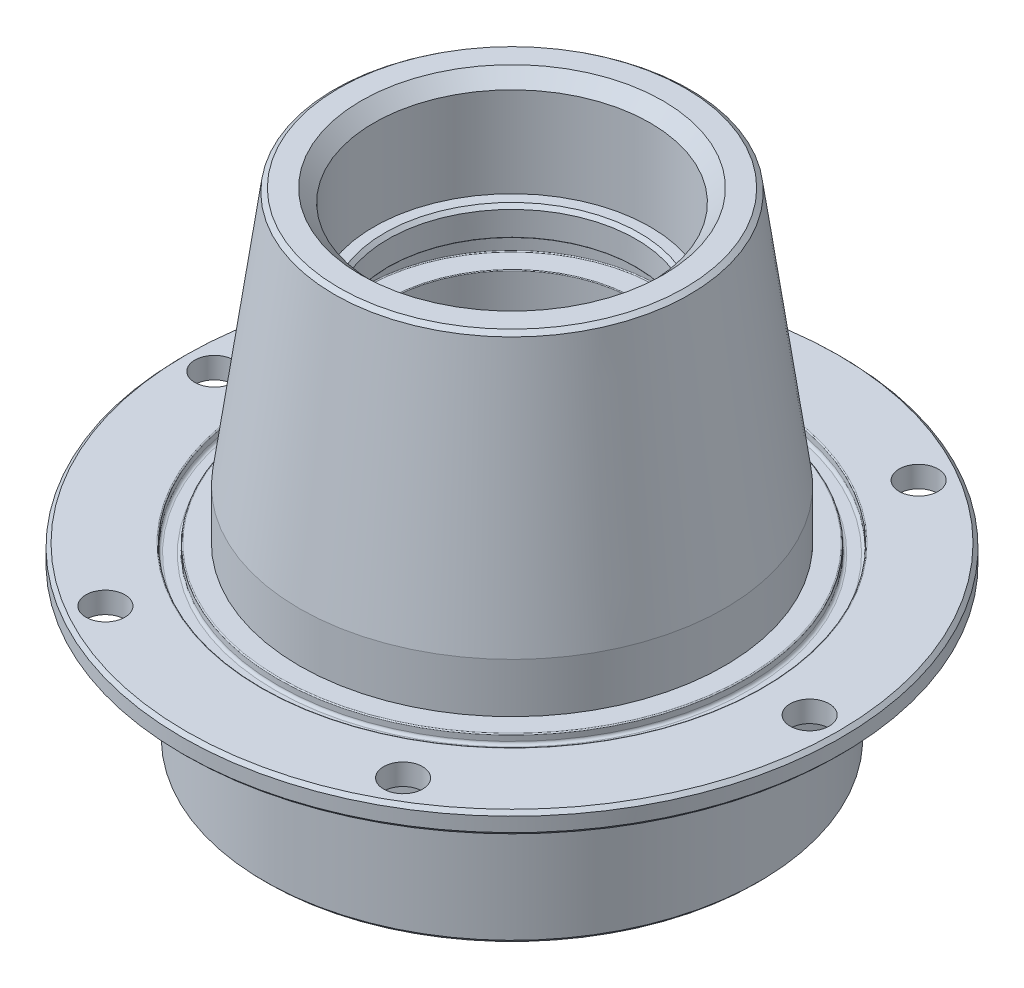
ISO-10303-21;
HEADER;
FILE_DESCRIPTION(('STEP AP214'),'2;1');
FILE_NAME('part.step','',(''),(''),'','','');
FILE_SCHEMA(('AUTOMOTIVE_DESIGN { 1 0 10303 214 1 1 1 1 }'));
ENDSEC;
DATA;
#1=APPLICATION_CONTEXT('core data for automotive mechanical design processes');
#2=APPLICATION_PROTOCOL_DEFINITION('international standard','automotive_design',2000,#1);
#3=PRODUCT_CONTEXT('',#1,'mechanical');
#4=PRODUCT('Part','Part','',(#3));
#5=PRODUCT_RELATED_PRODUCT_CATEGORY('part','',(#4));
#6=PRODUCT_DEFINITION_FORMATION('','',#4);
#7=PRODUCT_DEFINITION_CONTEXT('part definition',#1,'design');
#8=PRODUCT_DEFINITION('design','',#6,#7);
#9=PRODUCT_DEFINITION_SHAPE('','',#8);
#10=(LENGTH_UNIT() NAMED_UNIT(*) SI_UNIT(.MILLI.,.METRE.));
#11=(NAMED_UNIT(*) PLANE_ANGLE_UNIT() SI_UNIT($,.RADIAN.));
#12=(NAMED_UNIT(*) SI_UNIT($,.STERADIAN.) SOLID_ANGLE_UNIT());
#13=UNCERTAINTY_MEASURE_WITH_UNIT(LENGTH_MEASURE(1.E-05),#10,'distance_accuracy_value','');
#14=(GEOMETRIC_REPRESENTATION_CONTEXT(3) GLOBAL_UNCERTAINTY_ASSIGNED_CONTEXT((#13)) GLOBAL_UNIT_ASSIGNED_CONTEXT((#10,
#11,#12)) REPRESENTATION_CONTEXT('',''));
#15=CARTESIAN_POINT('',(0.,0.,0.));
#16=DIRECTION('',(0.,0.,1.));
#17=DIRECTION('',(1.,0.,0.));
#18=AXIS2_PLACEMENT_3D('',#15,#16,#17);
#19=CARTESIAN_POINT('',(0.,0.,0.));
#20=DIRECTION('',(0.,-1.,0.));
#21=DIRECTION('',(0.,0.,-1.));
#22=AXIS2_PLACEMENT_3D('',#19,#20,#21);
#23=CONICAL_SURFACE('',#22,25.,0.136484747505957);
#24=CARTESIAN_POINT('',(0.,-0.495350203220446,0.));
#25=DIRECTION('',(0.,1.,0.));
#26=DIRECTION('',(0.,0.,1.));
#27=AXIS2_PLACEMENT_3D('',#24,#25,#26);
#28=CIRCLE('',#27,25.0680307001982);
#29=CARTESIAN_POINT('',(0.,-0.495350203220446,25.0680307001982));
#30=VERTEX_POINT('',#29);
#31=EDGE_CURVE('E118',#30,#30,#28,.F.);
#32=ORIENTED_EDGE('',*,*,#31,.T.);
#33=EDGE_LOOP('',(#32));
#34=FACE_BOUND('',#33,.T.);
#35=CARTESIAN_POINT('',(0.,-36.4063725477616,0.));
#36=DIRECTION('',(0.,1.,0.));
#37=DIRECTION('',(0.,0.,1.));
#38=AXIS2_PLACEMENT_3D('',#35,#36,#37);
#39=CIRCLE('',#38,30.);
#40=CARTESIAN_POINT('',(0.,-36.4063725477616,30.));
#41=VERTEX_POINT('',#40);
#42=EDGE_CURVE('E166',#41,#41,#39,.T.);
#43=ORIENTED_EDGE('',*,*,#42,.T.);
#44=EDGE_LOOP('',(#43));
#45=FACE_BOUND('',#44,.T.);
#46=ADVANCED_FACE('F32',(#34,#45),#23,.T.);
#47=CARTESIAN_POINT('',(0.,58.1117219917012,0.));
#48=DIRECTION('',(0.,1.,0.));
#49=DIRECTION('',(0.,0.,1.));
#50=AXIS2_PLACEMENT_3D('',#47,#48,#49);
#51=CYLINDRICAL_SURFACE('',#50,30.);
#52=CARTESIAN_POINT('',(0.,-43.4063725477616,0.));
#53=DIRECTION('',(0.,1.,0.));
#54=DIRECTION('',(0.,0.,1.));
#55=AXIS2_PLACEMENT_3D('',#52,#53,#54);
#56=CIRCLE('',#55,30.);
#57=CARTESIAN_POINT('',(0.,-43.4063725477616,30.));
#58=VERTEX_POINT('',#57);
#59=EDGE_CURVE('E169',#58,#58,#56,.T.);
#60=ORIENTED_EDGE('',*,*,#59,.T.);
#61=EDGE_LOOP('',(#60));
#62=FACE_BOUND('',#61,.T.);
#63=ORIENTED_EDGE('',*,*,#42,.F.);
#64=EDGE_LOOP('',(#63));
#65=FACE_BOUND('',#64,.T.);
#66=ADVANCED_FACE('F281',(#62,#65),#51,.T.);
#67=CARTESIAN_POINT('',(-33.,-43.4063725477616,0.));
#68=DIRECTION('',(0.,1.,0.));
#69=DIRECTION('',(0.,0.,1.));
#70=AXIS2_PLACEMENT_3D('',#67,#68,#69);
#71=PLANE('',#70);
#72=CARTESIAN_POINT('',(0.,-43.4063725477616,0.));
#73=DIRECTION('',(0.,1.,0.));
#74=DIRECTION('',(0.,0.,1.));
#75=AXIS2_PLACEMENT_3D('',#72,#73,#74);
#76=CIRCLE('',#75,32.85);
#77=CARTESIAN_POINT('',(0.,-43.4063725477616,32.85));
#78=VERTEX_POINT('',#77);
#79=EDGE_CURVE('E109',#78,#78,#76,.T.);
#80=ORIENTED_EDGE('',*,*,#79,.T.);
#81=EDGE_LOOP('',(#80));
#82=FACE_BOUND('',#81,.T.);
#83=ORIENTED_EDGE('',*,*,#59,.F.);
#84=EDGE_LOOP('',(#83));
#85=FACE_BOUND('',#84,.T.);
#86=ADVANCED_FACE('F287',(#82,#85),#71,.T.);
#87=CARTESIAN_POINT('',(0.,58.1117219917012,0.));
#88=DIRECTION('',(0.,1.,0.));
#89=DIRECTION('',(0.,0.,1.));
#90=AXIS2_PLACEMENT_3D('',#87,#88,#89);
#91=CYLINDRICAL_SURFACE('',#90,33.);
#92=CARTESIAN_POINT('',(0.,-44.3063725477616,0.));
#93=DIRECTION('',(0.,1.,0.));
#94=DIRECTION('',(0.,0.,1.));
#95=AXIS2_PLACEMENT_3D('',#92,#93,#94);
#96=CIRCLE('',#95,33.);
#97=CARTESIAN_POINT('',(0.,-44.3063725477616,33.));
#98=VERTEX_POINT('',#97);
#99=EDGE_CURVE('E88',#98,#98,#96,.T.);
#100=ORIENTED_EDGE('',*,*,#99,.T.);
#101=EDGE_LOOP('',(#100));
#102=FACE_BOUND('',#101,.T.);
#103=CARTESIAN_POINT('',(0.,-43.5563725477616,0.));
#104=DIRECTION('',(0.,1.,0.));
#105=DIRECTION('',(0.,0.,1.));
#106=AXIS2_PLACEMENT_3D('',#103,#104,#105);
#107=CIRCLE('',#106,33.);
#108=CARTESIAN_POINT('',(0.,-43.5563725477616,33.));
#109=VERTEX_POINT('',#108);
#110=EDGE_CURVE('E106',#109,#109,#107,.F.);
#111=ORIENTED_EDGE('',*,*,#110,.T.);
#112=EDGE_LOOP('',(#111));
#113=FACE_BOUND('',#112,.T.);
#114=ADVANCED_FACE('F403',(#102,#113),#91,.T.);
#115=CARTESIAN_POINT('',(-35.28,-44.7063725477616,0.));
#116=DIRECTION('',(0.,1.,0.));
#117=DIRECTION('',(0.,0.,1.));
#118=AXIS2_PLACEMENT_3D('',#115,#116,#117);
#119=PLANE('',#118);
#120=CARTESIAN_POINT('',(0.,-44.7063725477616,0.));
#121=DIRECTION('',(0.,1.,0.));
#122=DIRECTION('',(0.,0.,1.));
#123=AXIS2_PLACEMENT_3D('',#120,#121,#122);
#124=CIRCLE('',#123,34.88);
#125=CARTESIAN_POINT('',(0.,-44.7063725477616,34.88));
#126=VERTEX_POINT('',#125);
#127=EDGE_CURVE('E94',#126,#126,#124,.T.);
#128=ORIENTED_EDGE('',*,*,#127,.T.);
#129=EDGE_LOOP('',(#128));
#130=FACE_BOUND('',#129,.T.);
#131=CARTESIAN_POINT('',(0.,-44.7063725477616,0.));
#132=DIRECTION('',(0.,1.,0.));
#133=DIRECTION('',(0.,0.,1.));
#134=AXIS2_PLACEMENT_3D('',#131,#132,#133);
#135=CIRCLE('',#134,33.4);
#136=CARTESIAN_POINT('',(0.,-44.7063725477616,33.4));
#137=VERTEX_POINT('',#136);
#138=EDGE_CURVE('E97',#137,#137,#135,.F.);
#139=ORIENTED_EDGE('',*,*,#138,.T.);
#140=EDGE_LOOP('',(#139));
#141=FACE_BOUND('',#140,.T.);
#142=ADVANCED_FACE('F399',(#130,#141),#119,.T.);
#143=CARTESIAN_POINT('',(0.,58.1117219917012,0.));
#144=DIRECTION('',(0.,1.,0.));
#145=DIRECTION('',(0.,0.,1.));
#146=AXIS2_PLACEMENT_3D('',#143,#144,#145);
#147=CYLINDRICAL_SURFACE('',#146,35.28);
#148=CARTESIAN_POINT('',(0.,-44.3063725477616,0.));
#149=DIRECTION('',(0.,1.,0.));
#150=DIRECTION('',(0.,0.,1.));
#151=AXIS2_PLACEMENT_3D('',#148,#149,#150);
#152=CIRCLE('',#151,35.28);
#153=CARTESIAN_POINT('',(0.,-44.3063725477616,35.28));
#154=VERTEX_POINT('',#153);
#155=EDGE_CURVE('E91',#154,#154,#152,.F.);
#156=ORIENTED_EDGE('',*,*,#155,.T.);
#157=EDGE_LOOP('',(#156));
#158=FACE_BOUND('',#157,.T.);
#159=CARTESIAN_POINT('',(0.,-43.5563725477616,0.));
#160=DIRECTION('',(0.,1.,0.));
#161=DIRECTION('',(0.,0.,1.));
#162=AXIS2_PLACEMENT_3D('',#159,#160,#161);
#163=CIRCLE('',#162,35.28);
#164=CARTESIAN_POINT('',(0.,-43.5563725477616,35.28));
#165=VERTEX_POINT('',#164);
#166=EDGE_CURVE('E103',#165,#165,#163,.T.);
#167=ORIENTED_EDGE('',*,*,#166,.T.);
#168=EDGE_LOOP('',(#167));
#169=FACE_BOUND('',#168,.T.);
#170=ADVANCED_FACE('F247',(#158,#169),#147,.F.);
#171=CARTESIAN_POINT('',(-46.5,-43.4063725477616,0.));
#172=DIRECTION('',(0.,1.,0.));
#173=DIRECTION('',(0.,0.,1.));
#174=AXIS2_PLACEMENT_3D('',#171,#172,#173);
#175=PLANE('',#174);
#176=CARTESIAN_POINT('',(-21.0000000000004,-43.4063725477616,36.3730669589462));
#177=DIRECTION('',(0.,1.,0.));
#178=DIRECTION('',(0.866025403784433,0.,0.50000000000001));
#179=AXIS2_PLACEMENT_3D('',#176,#177,#178);
#180=CIRCLE('',#179,2.75);
#181=CARTESIAN_POINT('',(-18.6184301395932,-43.4063725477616,37.7480669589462));
#182=VERTEX_POINT('',#181);
#183=EDGE_CURVE('E227',#182,#182,#180,.T.);
#184=ORIENTED_EDGE('',*,*,#183,.F.);
#185=EDGE_LOOP('',(#184));
#186=FACE_BOUND('',#185,.T.);
#187=CARTESIAN_POINT('',(20.9999999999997,-43.4063725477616,36.3730669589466));
#188=DIRECTION('',(0.,1.,0.));
#189=DIRECTION('',(0.866025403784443,0.,-0.499999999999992));
#190=AXIS2_PLACEMENT_3D('',#187,#188,#189);
#191=CIRCLE('',#190,2.75);
#192=CARTESIAN_POINT('',(23.3815698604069,-43.4063725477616,34.9980669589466));
#193=VERTEX_POINT('',#192);
#194=EDGE_CURVE('E221',#193,#193,#191,.T.);
#195=ORIENTED_EDGE('',*,*,#194,.F.);
#196=EDGE_LOOP('',(#195));
#197=FACE_BOUND('',#196,.T.);
#198=CARTESIAN_POINT('',(42.,-43.4063725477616,2.93284602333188E-13));
#199=DIRECTION('',(0.,1.,0.));
#200=DIRECTION('',(0.,0.,-1.));
#201=AXIS2_PLACEMENT_3D('',#198,#199,#200);
#202=CIRCLE('',#201,2.75);
#203=CARTESIAN_POINT('',(42.,-43.4063725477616,-2.74999999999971));
#204=VERTEX_POINT('',#203);
#205=EDGE_CURVE('E215',#204,#204,#202,.T.);
#206=ORIENTED_EDGE('',*,*,#205,.F.);
#207=EDGE_LOOP('',(#206));
#208=FACE_BOUND('',#207,.T.);
#209=CARTESIAN_POINT('',(21.0000000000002,-43.4063725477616,-36.3730669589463));
#210=DIRECTION('',(0.,1.,0.));
#211=DIRECTION('',(-0.866025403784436,0.,-0.500000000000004));
#212=AXIS2_PLACEMENT_3D('',#209,#210,#211);
#213=CIRCLE('',#212,2.75);
#214=CARTESIAN_POINT('',(18.618430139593,-43.4063725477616,-37.7480669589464));
#215=VERTEX_POINT('',#214);
#216=EDGE_CURVE('E209',#215,#215,#213,.T.);
#217=ORIENTED_EDGE('',*,*,#216,.F.);
#218=EDGE_LOOP('',(#217));
#219=FACE_BOUND('',#218,.T.);
#220=CARTESIAN_POINT('',(-20.9999999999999,-43.4063725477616,-36.3730669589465));
#221=DIRECTION('',(0.,1.,0.));
#222=DIRECTION('',(-0.86602540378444,0.,0.499999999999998));
#223=AXIS2_PLACEMENT_3D('',#220,#221,#222);
#224=CIRCLE('',#223,2.75);
#225=CARTESIAN_POINT('',(-23.3815698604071,-43.4063725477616,-34.9980669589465));
#226=VERTEX_POINT('',#225);
#227=EDGE_CURVE('E203',#226,#226,#224,.T.);
#228=ORIENTED_EDGE('',*,*,#227,.F.);
#229=EDGE_LOOP('',(#228));
#230=FACE_BOUND('',#229,.T.);
#231=CARTESIAN_POINT('',(-42.,-43.4063725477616,0.));
#232=DIRECTION('',(0.,1.,0.));
#233=DIRECTION('',(0.,0.,1.));
#234=AXIS2_PLACEMENT_3D('',#231,#232,#233);
#235=CIRCLE('',#234,2.75);
#236=CARTESIAN_POINT('',(-42.,-43.4063725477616,2.75));
#237=VERTEX_POINT('',#236);
#238=EDGE_CURVE('E197',#237,#237,#235,.T.);
#239=ORIENTED_EDGE('',*,*,#238,.F.);
#240=EDGE_LOOP('',(#239));
#241=FACE_BOUND('',#240,.T.);
#242=CARTESIAN_POINT('',(0.,-43.4063725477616,0.));
#243=DIRECTION('',(0.,1.,0.));
#244=DIRECTION('',(0.,0.,1.));
#245=AXIS2_PLACEMENT_3D('',#242,#243,#244);
#246=CIRCLE('',#245,35.43);
#247=CARTESIAN_POINT('',(0.,-43.4063725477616,35.43));
#248=VERTEX_POINT('',#247);
#249=EDGE_CURVE('E100',#248,#248,#246,.F.);
#250=ORIENTED_EDGE('',*,*,#249,.T.);
#251=EDGE_LOOP('',(#250));
#252=FACE_BOUND('',#251,.T.);
#253=CARTESIAN_POINT('',(0.,-43.4063725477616,0.));
#254=DIRECTION('',(0.,1.,0.));
#255=DIRECTION('',(0.,0.,1.));
#256=AXIS2_PLACEMENT_3D('',#253,#254,#255);
#257=CIRCLE('',#256,46.);
#258=CARTESIAN_POINT('',(0.,-43.4063725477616,46.));
#259=VERTEX_POINT('',#258);
#260=EDGE_CURVE('E148',#259,#259,#257,.T.);
#261=ORIENTED_EDGE('',*,*,#260,.T.);
#262=EDGE_LOOP('',(#261));
#263=FACE_BOUND('',#262,.T.);
#264=ADVANCED_FACE('F243',(#186,#197,#208,#219,#230,#241,#252,#263),#175,.T.);
#265=CARTESIAN_POINT('',(0.,58.1117219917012,0.));
#266=DIRECTION('',(0.,1.,0.));
#267=DIRECTION('',(0.,0.,1.));
#268=AXIS2_PLACEMENT_3D('',#265,#266,#267);
#269=CYLINDRICAL_SURFACE('',#268,46.5);
#270=CARTESIAN_POINT('',(0.,-43.9063725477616,0.));
#271=DIRECTION('',(0.,1.,0.));
#272=DIRECTION('',(0.,0.,1.));
#273=AXIS2_PLACEMENT_3D('',#270,#271,#272);
#274=CIRCLE('',#273,46.5);
#275=CARTESIAN_POINT('',(0.,-43.9063725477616,46.5));
#276=VERTEX_POINT('',#275);
#277=EDGE_CURVE('E142',#276,#276,#274,.F.);
#278=ORIENTED_EDGE('',*,*,#277,.T.);
#279=EDGE_LOOP('',(#278));
#280=FACE_BOUND('',#279,.T.);
#281=CARTESIAN_POINT('',(0.,-45.9063725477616,0.));
#282=DIRECTION('',(0.,-1.,0.));
#283=DIRECTION('',(0.,0.,-1.));
#284=AXIS2_PLACEMENT_3D('',#281,#282,#283);
#285=CIRCLE('',#284,46.5);
#286=CARTESIAN_POINT('',(0.,-45.9063725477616,-46.5));
#287=VERTEX_POINT('',#286);
#288=EDGE_CURVE('E145',#287,#287,#285,.F.);
#289=ORIENTED_EDGE('',*,*,#288,.T.);
#290=EDGE_LOOP('',(#289));
#291=FACE_BOUND('',#290,.T.);
#292=ADVANCED_FACE('F246',(#280,#291),#269,.T.);
#293=CARTESIAN_POINT('',(-35.,-46.4063725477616,0.));
#294=DIRECTION('',(0.,-1.,0.));
#295=DIRECTION('',(0.,0.,-1.));
#296=AXIS2_PLACEMENT_3D('',#293,#294,#295);
#297=PLANE('',#296);
#298=CARTESIAN_POINT('',(-21.0000000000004,-46.4063725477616,36.3730669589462));
#299=DIRECTION('',(0.,1.,0.));
#300=DIRECTION('',(0.866025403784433,0.,0.50000000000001));
#301=AXIS2_PLACEMENT_3D('',#298,#299,#300);
#302=CIRCLE('',#301,2.75);
#303=CARTESIAN_POINT('',(-18.6184301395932,-46.4063725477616,37.7480669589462));
#304=VERTEX_POINT('',#303);
#305=EDGE_CURVE('E224',#304,#304,#302,.T.);
#306=ORIENTED_EDGE('',*,*,#305,.T.);
#307=EDGE_LOOP('',(#306));
#308=FACE_BOUND('',#307,.T.);
#309=CARTESIAN_POINT('',(20.9999999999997,-46.4063725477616,36.3730669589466));
#310=DIRECTION('',(0.,1.,0.));
#311=DIRECTION('',(0.866025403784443,0.,-0.499999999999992));
#312=AXIS2_PLACEMENT_3D('',#309,#310,#311);
#313=CIRCLE('',#312,2.75);
#314=CARTESIAN_POINT('',(23.3815698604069,-46.4063725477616,34.9980669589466));
#315=VERTEX_POINT('',#314);
#316=EDGE_CURVE('E218',#315,#315,#313,.T.);
#317=ORIENTED_EDGE('',*,*,#316,.T.);
#318=EDGE_LOOP('',(#317));
#319=FACE_BOUND('',#318,.T.);
#320=CARTESIAN_POINT('',(42.,-46.4063725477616,2.93284602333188E-13));
#321=DIRECTION('',(0.,1.,0.));
#322=DIRECTION('',(0.,0.,-1.));
#323=AXIS2_PLACEMENT_3D('',#320,#321,#322);
#324=CIRCLE('',#323,2.75);
#325=CARTESIAN_POINT('',(42.,-46.4063725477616,-2.74999999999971));
#326=VERTEX_POINT('',#325);
#327=EDGE_CURVE('E212',#326,#326,#324,.T.);
#328=ORIENTED_EDGE('',*,*,#327,.T.);
#329=EDGE_LOOP('',(#328));
#330=FACE_BOUND('',#329,.T.);
#331=CARTESIAN_POINT('',(21.0000000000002,-46.4063725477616,-36.3730669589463));
#332=DIRECTION('',(0.,1.,0.));
#333=DIRECTION('',(-0.866025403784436,0.,-0.500000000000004));
#334=AXIS2_PLACEMENT_3D('',#331,#332,#333);
#335=CIRCLE('',#334,2.75);
#336=CARTESIAN_POINT('',(18.618430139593,-46.4063725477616,-37.7480669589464));
#337=VERTEX_POINT('',#336);
#338=EDGE_CURVE('E206',#337,#337,#335,.T.);
#339=ORIENTED_EDGE('',*,*,#338,.T.);
#340=EDGE_LOOP('',(#339));
#341=FACE_BOUND('',#340,.T.);
#342=CARTESIAN_POINT('',(-20.9999999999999,-46.4063725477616,-36.3730669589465));
#343=DIRECTION('',(0.,1.,0.));
#344=DIRECTION('',(-0.86602540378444,0.,0.499999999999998));
#345=AXIS2_PLACEMENT_3D('',#342,#343,#344);
#346=CIRCLE('',#345,2.75);
#347=CARTESIAN_POINT('',(-23.3815698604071,-46.4063725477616,-34.9980669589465));
#348=VERTEX_POINT('',#347);
#349=EDGE_CURVE('E200',#348,#348,#346,.T.);
#350=ORIENTED_EDGE('',*,*,#349,.T.);
#351=EDGE_LOOP('',(#350));
#352=FACE_BOUND('',#351,.T.);
#353=CARTESIAN_POINT('',(-42.,-46.4063725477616,0.));
#354=DIRECTION('',(0.,1.,0.));
#355=DIRECTION('',(0.,0.,1.));
#356=AXIS2_PLACEMENT_3D('',#353,#354,#355);
#357=CIRCLE('',#356,2.75);
#358=CARTESIAN_POINT('',(-42.,-46.4063725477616,2.75));
#359=VERTEX_POINT('',#358);
#360=EDGE_CURVE('E196',#359,#359,#357,.T.);
#361=ORIENTED_EDGE('',*,*,#360,.T.);
#362=EDGE_LOOP('',(#361));
#363=FACE_BOUND('',#362,.T.);
#364=CARTESIAN_POINT('',(0.,-46.4063725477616,0.));
#365=DIRECTION('',(0.,-1.,0.));
#366=DIRECTION('',(0.,0.,-1.));
#367=AXIS2_PLACEMENT_3D('',#364,#365,#366);
#368=CIRCLE('',#367,36.);
#369=CARTESIAN_POINT('',(0.,-46.4063725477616,-36.));
#370=VERTEX_POINT('',#369);
#371=EDGE_CURVE('E115',#370,#370,#368,.F.);
#372=ORIENTED_EDGE('',*,*,#371,.T.);
#373=EDGE_LOOP('',(#372));
#374=FACE_BOUND('',#373,.T.);
#375=CARTESIAN_POINT('',(0.,-46.4063725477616,0.));
#376=DIRECTION('',(0.,-1.,0.));
#377=DIRECTION('',(0.,0.,-1.));
#378=AXIS2_PLACEMENT_3D('',#375,#376,#377);
#379=CIRCLE('',#378,46.);
#380=CARTESIAN_POINT('',(0.,-46.4063725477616,-46.));
#381=VERTEX_POINT('',#380);
#382=EDGE_CURVE('E139',#381,#381,#379,.T.);
#383=ORIENTED_EDGE('',*,*,#382,.T.);
#384=EDGE_LOOP('',(#383));
#385=FACE_BOUND('',#384,.T.);
#386=ADVANCED_FACE('F233',(#308,#319,#330,#341,#352,#363,#374,#385),#297,.T.);
#387=CARTESIAN_POINT('',(0.,58.1117219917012,0.));
#388=DIRECTION('',(0.,1.,0.));
#389=DIRECTION('',(0.,0.,1.));
#390=AXIS2_PLACEMENT_3D('',#387,#388,#389);
#391=CYLINDRICAL_SURFACE('',#390,35.);
#392=CARTESIAN_POINT('',(0.,-47.4063725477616,0.));
#393=DIRECTION('',(0.,-1.,0.));
#394=DIRECTION('',(0.,0.,-1.));
#395=AXIS2_PLACEMENT_3D('',#392,#393,#394);
#396=CIRCLE('',#395,35.);
#397=CARTESIAN_POINT('',(0.,-47.4063725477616,-35.));
#398=VERTEX_POINT('',#397);
#399=EDGE_CURVE('E112',#398,#398,#396,.T.);
#400=ORIENTED_EDGE('',*,*,#399,.T.);
#401=EDGE_LOOP('',(#400));
#402=FACE_BOUND('',#401,.T.);
#403=CARTESIAN_POINT('',(0.,-67.2,0.));
#404=DIRECTION('',(0.,-1.,0.));
#405=DIRECTION('',(0.,0.,-1.));
#406=AXIS2_PLACEMENT_3D('',#403,#404,#405);
#407=CIRCLE('',#406,35.);
#408=CARTESIAN_POINT('',(0.,-67.2,-35.));
#409=VERTEX_POINT('',#408);
#410=EDGE_CURVE('E157',#409,#409,#407,.F.);
#411=ORIENTED_EDGE('',*,*,#410,.T.);
#412=EDGE_LOOP('',(#411));
#413=FACE_BOUND('',#412,.T.);
#414=ADVANCED_FACE('F387',(#402,#413),#391,.T.);
#415=CARTESIAN_POINT('',(-31.,-67.7,0.));
#416=DIRECTION('',(0.,-1.,0.));
#417=DIRECTION('',(0.,0.,-1.));
#418=AXIS2_PLACEMENT_3D('',#415,#416,#417);
#419=PLANE('',#418);
#420=CARTESIAN_POINT('',(0.,-67.7,0.));
#421=DIRECTION('',(0.,-1.,0.));
#422=DIRECTION('',(0.,0.,-1.));
#423=AXIS2_PLACEMENT_3D('',#420,#421,#422);
#424=CIRCLE('',#423,34.5);
#425=CARTESIAN_POINT('',(0.,-67.7,-34.5));
#426=VERTEX_POINT('',#425);
#427=EDGE_CURVE('E151',#426,#426,#424,.T.);
#428=ORIENTED_EDGE('',*,*,#427,.T.);
#429=EDGE_LOOP('',(#428));
#430=FACE_BOUND('',#429,.T.);
#431=CARTESIAN_POINT('',(0.,-67.7,0.));
#432=DIRECTION('',(0.,-1.,0.));
#433=DIRECTION('',(0.,0.,-1.));
#434=AXIS2_PLACEMENT_3D('',#431,#432,#433);
#435=CIRCLE('',#434,31.5);
#436=CARTESIAN_POINT('',(0.,-67.7,-31.5));
#437=VERTEX_POINT('',#436);
#438=EDGE_CURVE('E154',#437,#437,#435,.F.);
#439=ORIENTED_EDGE('',*,*,#438,.T.);
#440=EDGE_LOOP('',(#439));
#441=FACE_BOUND('',#440,.T.);
#442=ADVANCED_FACE('F383',(#430,#441),#419,.T.);
#443=CARTESIAN_POINT('',(0.,58.1117219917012,0.));
#444=DIRECTION('',(0.,1.,0.));
#445=DIRECTION('',(0.,0.,1.));
#446=AXIS2_PLACEMENT_3D('',#443,#444,#445);
#447=CYLINDRICAL_SURFACE('',#446,31.);
#448=CARTESIAN_POINT('',(0.,-67.2,0.));
#449=DIRECTION('',(0.,-1.,0.));
#450=DIRECTION('',(0.,0.,-1.));
#451=AXIS2_PLACEMENT_3D('',#448,#449,#450);
#452=CIRCLE('',#451,31.);
#453=CARTESIAN_POINT('',(0.,-67.2,-31.));
#454=VERTEX_POINT('',#453);
#455=EDGE_CURVE('E136',#454,#454,#452,.T.);
#456=ORIENTED_EDGE('',*,*,#455,.T.);
#457=EDGE_LOOP('',(#456));
#458=FACE_BOUND('',#457,.T.);
#459=CARTESIAN_POINT('',(0.,-63.2,0.));
#460=DIRECTION('',(0.,1.,0.));
#461=DIRECTION('',(0.,0.,1.));
#462=AXIS2_PLACEMENT_3D('',#459,#460,#461);
#463=CIRCLE('',#462,31.);
#464=CARTESIAN_POINT('',(0.,-63.2,31.));
#465=VERTEX_POINT('',#464);
#466=EDGE_CURVE('E172',#465,#465,#463,.T.);
#467=ORIENTED_EDGE('',*,*,#466,.T.);
#468=EDGE_LOOP('',(#467));
#469=FACE_BOUND('',#468,.T.);
#470=ADVANCED_FACE('F379',(#458,#469),#447,.F.);
#471=CARTESIAN_POINT('',(-31.,-63.2,0.));
#472=DIRECTION('',(0.,1.,0.));
#473=DIRECTION('',(0.,0.,1.));
#474=AXIS2_PLACEMENT_3D('',#471,#472,#473);
#475=PLANE('',#474);
#476=CARTESIAN_POINT('',(0.,-63.2,0.));
#477=DIRECTION('',(0.,1.,0.));
#478=DIRECTION('',(0.,0.,1.));
#479=AXIS2_PLACEMENT_3D('',#476,#477,#478);
#480=CIRCLE('',#479,32.5);
#481=CARTESIAN_POINT('',(0.,-63.2,32.5));
#482=VERTEX_POINT('',#481);
#483=EDGE_CURVE('E175',#482,#482,#480,.T.);
#484=ORIENTED_EDGE('',*,*,#483,.T.);
#485=EDGE_LOOP('',(#484));
#486=FACE_BOUND('',#485,.T.);
#487=ORIENTED_EDGE('',*,*,#466,.F.);
#488=EDGE_LOOP('',(#487));
#489=FACE_BOUND('',#488,.T.);
#490=ADVANCED_FACE('F375',(#486,#489),#475,.T.);
#491=CARTESIAN_POINT('',(0.,58.1117219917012,0.));
#492=DIRECTION('',(0.,1.,0.));
#493=DIRECTION('',(0.,0.,1.));
#494=AXIS2_PLACEMENT_3D('',#491,#492,#493);
#495=CYLINDRICAL_SURFACE('',#494,32.5);
#496=CARTESIAN_POINT('',(0.,-61.,0.));
#497=DIRECTION('',(0.,1.,0.));
#498=DIRECTION('',(0.,0.,1.));
#499=AXIS2_PLACEMENT_3D('',#496,#497,#498);
#500=CIRCLE('',#499,32.5);
#501=CARTESIAN_POINT('',(0.,-61.,32.5));
#502=VERTEX_POINT('',#501);
#503=EDGE_CURVE('E178',#502,#502,#500,.T.);
#504=ORIENTED_EDGE('',*,*,#503,.T.);
#505=EDGE_LOOP('',(#504));
#506=FACE_BOUND('',#505,.T.);
#507=ORIENTED_EDGE('',*,*,#483,.F.);
#508=EDGE_LOOP('',(#507));
#509=FACE_BOUND('',#508,.T.);
#510=ADVANCED_FACE('F371',(#506,#509),#495,.F.);
#511=CARTESIAN_POINT('',(-31.,-61.,0.));
#512=DIRECTION('',(0.,-1.,0.));
#513=DIRECTION('',(0.,0.,-1.));
#514=AXIS2_PLACEMENT_3D('',#511,#512,#513);
#515=PLANE('',#514);
#516=CARTESIAN_POINT('',(0.,-61.,0.));
#517=DIRECTION('',(0.,1.,0.));
#518=DIRECTION('',(0.,0.,1.));
#519=AXIS2_PLACEMENT_3D('',#516,#517,#518);
#520=CIRCLE('',#519,31.);
#521=CARTESIAN_POINT('',(0.,-61.,31.));
#522=VERTEX_POINT('',#521);
#523=EDGE_CURVE('E181',#522,#522,#520,.T.);
#524=ORIENTED_EDGE('',*,*,#523,.T.);
#525=EDGE_LOOP('',(#524));
#526=FACE_BOUND('',#525,.T.);
#527=ORIENTED_EDGE('',*,*,#503,.F.);
#528=EDGE_LOOP('',(#527));
#529=FACE_BOUND('',#528,.T.);
#530=ADVANCED_FACE('F367',(#526,#529),#515,.T.);
#531=CARTESIAN_POINT('',(0.,58.1117219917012,0.));
#532=DIRECTION('',(0.,1.,0.));
#533=DIRECTION('',(0.,0.,1.));
#534=AXIS2_PLACEMENT_3D('',#531,#532,#533);
#535=CYLINDRICAL_SURFACE('',#534,31.);
#536=CARTESIAN_POINT('',(0.,-47.,0.));
#537=DIRECTION('',(0.,1.,0.));
#538=DIRECTION('',(0.,0.,1.));
#539=AXIS2_PLACEMENT_3D('',#536,#537,#538);
#540=CIRCLE('',#539,31.);
#541=CARTESIAN_POINT('',(0.,-47.,31.));
#542=VERTEX_POINT('',#541);
#543=EDGE_CURVE('E184',#542,#542,#540,.T.);
#544=ORIENTED_EDGE('',*,*,#543,.T.);
#545=EDGE_LOOP('',(#544));
#546=FACE_BOUND('',#545,.T.);
#547=ORIENTED_EDGE('',*,*,#523,.F.);
#548=EDGE_LOOP('',(#547));
#549=FACE_BOUND('',#548,.T.);
#550=ADVANCED_FACE('F363',(#546,#549),#535,.F.);
#551=CARTESIAN_POINT('',(-27.,-47.,0.));
#552=DIRECTION('',(0.,-1.,0.));
#553=DIRECTION('',(0.,0.,-1.));
#554=AXIS2_PLACEMENT_3D('',#551,#552,#553);
#555=PLANE('',#554);
#556=CARTESIAN_POINT('',(0.,-47.,0.));
#557=DIRECTION('',(0.,1.,0.));
#558=DIRECTION('',(0.,0.,1.));
#559=AXIS2_PLACEMENT_3D('',#556,#557,#558);
#560=CIRCLE('',#559,27.);
#561=CARTESIAN_POINT('',(0.,-47.,27.));
#562=VERTEX_POINT('',#561);
#563=EDGE_CURVE('E187',#562,#562,#560,.T.);
#564=ORIENTED_EDGE('',*,*,#563,.T.);
#565=EDGE_LOOP('',(#564));
#566=FACE_BOUND('',#565,.T.);
#567=ORIENTED_EDGE('',*,*,#543,.F.);
#568=EDGE_LOOP('',(#567));
#569=FACE_BOUND('',#568,.T.);
#570=ADVANCED_FACE('F359',(#566,#569),#555,.T.);
#571=CARTESIAN_POINT('',(0.,58.1117219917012,0.));
#572=DIRECTION('',(0.,1.,0.));
#573=DIRECTION('',(0.,0.,1.));
#574=AXIS2_PLACEMENT_3D('',#571,#572,#573);
#575=CYLINDRICAL_SURFACE('',#574,27.);
#576=CARTESIAN_POINT('',(0.,-46.5,0.));
#577=DIRECTION('',(0.,1.,0.));
#578=DIRECTION('',(0.,0.,1.));
#579=AXIS2_PLACEMENT_3D('',#576,#577,#578);
#580=CIRCLE('',#579,27.);
#581=CARTESIAN_POINT('',(0.,-46.5,27.));
#582=VERTEX_POINT('',#581);
#583=EDGE_CURVE('E190',#582,#582,#580,.T.);
#584=ORIENTED_EDGE('',*,*,#583,.T.);
#585=EDGE_LOOP('',(#584));
#586=FACE_BOUND('',#585,.T.);
#587=ORIENTED_EDGE('',*,*,#563,.F.);
#588=EDGE_LOOP('',(#587));
#589=FACE_BOUND('',#588,.T.);
#590=ADVANCED_FACE('F355',(#586,#589),#575,.F.);
#591=CARTESIAN_POINT('',(-17.5,-46.5,0.));
#592=DIRECTION('',(0.,-1.,0.));
#593=DIRECTION('',(0.,0.,-1.));
#594=AXIS2_PLACEMENT_3D('',#591,#592,#593);
#595=PLANE('',#594);
#596=CARTESIAN_POINT('',(0.,-46.5,0.));
#597=DIRECTION('',(0.,-1.,0.));
#598=DIRECTION('',(0.,0.,-1.));
#599=AXIS2_PLACEMENT_3D('',#596,#597,#598);
#600=CIRCLE('',#599,18.);
#601=CARTESIAN_POINT('',(0.,-46.5,-18.));
#602=VERTEX_POINT('',#601);
#603=EDGE_CURVE('E133',#602,#602,#600,.F.);
#604=ORIENTED_EDGE('',*,*,#603,.T.);
#605=EDGE_LOOP('',(#604));
#606=FACE_BOUND('',#605,.T.);
#607=ORIENTED_EDGE('',*,*,#583,.F.);
#608=EDGE_LOOP('',(#607));
#609=FACE_BOUND('',#608,.T.);
#610=ADVANCED_FACE('F351',(#606,#609),#595,.T.);
#611=CARTESIAN_POINT('',(0.,58.1117219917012,0.));
#612=DIRECTION('',(0.,1.,0.));
#613=DIRECTION('',(0.,0.,1.));
#614=AXIS2_PLACEMENT_3D('',#611,#612,#613);
#615=CYLINDRICAL_SURFACE('',#614,17.5);
#616=CARTESIAN_POINT('',(0.,-43.,0.));
#617=DIRECTION('',(0.,1.,0.));
#618=DIRECTION('',(0.,0.,1.));
#619=AXIS2_PLACEMENT_3D('',#616,#617,#618);
#620=CIRCLE('',#619,17.5);
#621=CARTESIAN_POINT('',(0.,-43.,17.5));
#622=VERTEX_POINT('',#621);
#623=EDGE_CURVE('E85',#622,#622,#620,.T.);
#624=ORIENTED_EDGE('',*,*,#623,.T.);
#625=EDGE_LOOP('',(#624));
#626=FACE_BOUND('',#625,.T.);
#627=CARTESIAN_POINT('',(0.,-46.,0.));
#628=DIRECTION('',(0.,-1.,0.));
#629=DIRECTION('',(0.,0.,-1.));
#630=AXIS2_PLACEMENT_3D('',#627,#628,#629);
#631=CIRCLE('',#630,17.5);
#632=CARTESIAN_POINT('',(0.,-46.,-17.5));
#633=VERTEX_POINT('',#632);
#634=EDGE_CURVE('E130',#633,#633,#631,.T.);
#635=ORIENTED_EDGE('',*,*,#634,.T.);
#636=EDGE_LOOP('',(#635));
#637=FACE_BOUND('',#636,.T.);
#638=ADVANCED_FACE('F348',(#626,#637),#615,.F.);
#639=CARTESIAN_POINT('',(-17.5,-42.9,0.));
#640=DIRECTION('',(0.,1.,0.));
#641=DIRECTION('',(0.,0.,1.));
#642=AXIS2_PLACEMENT_3D('',#639,#640,#641);
#643=PLANE('',#642);
#644=CARTESIAN_POINT('',(0.,-42.9,0.));
#645=DIRECTION('',(0.,1.,0.));
#646=DIRECTION('',(0.,0.,1.));
#647=AXIS2_PLACEMENT_3D('',#644,#645,#646);
#648=CIRCLE('',#647,20.59);
#649=CARTESIAN_POINT('',(0.,-42.9,20.59));
#650=VERTEX_POINT('',#649);
#651=EDGE_CURVE('E10',#650,#650,#648,.T.);
#652=ORIENTED_EDGE('',*,*,#651,.T.);
#653=EDGE_LOOP('',(#652));
#654=FACE_BOUND('',#653,.T.);
#655=CARTESIAN_POINT('',(0.,-42.9,0.));
#656=DIRECTION('',(0.,1.,0.));
#657=DIRECTION('',(0.,0.,1.));
#658=AXIS2_PLACEMENT_3D('',#655,#656,#657);
#659=CIRCLE('',#658,17.6);
#660=CARTESIAN_POINT('',(0.,-42.9,17.6));
#661=VERTEX_POINT('',#660);
#662=EDGE_CURVE('E82',#661,#661,#659,.F.);
#663=ORIENTED_EDGE('',*,*,#662,.T.);
#664=EDGE_LOOP('',(#663));
#665=FACE_BOUND('',#664,.T.);
#666=ADVANCED_FACE('F344',(#654,#665),#643,.T.);
#667=CARTESIAN_POINT('',(0.,58.1117219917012,0.));
#668=DIRECTION('',(0.,1.,0.));
#669=DIRECTION('',(0.,0.,1.));
#670=AXIS2_PLACEMENT_3D('',#667,#668,#669);
#671=CYLINDRICAL_SURFACE('',#670,20.72);
#672=CARTESIAN_POINT('',(0.,-39.13,0.));
#673=DIRECTION('',(0.,-1.,0.));
#674=DIRECTION('',(0.,0.,-1.));
#675=AXIS2_PLACEMENT_3D('',#672,#673,#674);
#676=CIRCLE('',#675,20.72);
#677=CARTESIAN_POINT('',(0.,-39.13,-20.72));
#678=VERTEX_POINT('',#677);
#679=EDGE_CURVE('E43',#678,#678,#676,.F.);
#680=ORIENTED_EDGE('',*,*,#679,.T.);
#681=EDGE_LOOP('',(#680));
#682=FACE_BOUND('',#681,.T.);
#683=CARTESIAN_POINT('',(0.,-42.77,0.));
#684=DIRECTION('',(0.,1.,0.));
#685=DIRECTION('',(0.,0.,1.));
#686=AXIS2_PLACEMENT_3D('',#683,#684,#685);
#687=CIRCLE('',#686,20.72);
#688=CARTESIAN_POINT('',(0.,-42.77,20.72));
#689=VERTEX_POINT('',#688);
#690=EDGE_CURVE('E47',#689,#689,#687,.F.);
#691=ORIENTED_EDGE('',*,*,#690,.T.);
#692=EDGE_LOOP('',(#691));
#693=FACE_BOUND('',#692,.T.);
#694=ADVANCED_FACE('F341',(#682,#693),#671,.F.);
#695=CARTESIAN_POINT('',(-17.5,-39.,0.));
#696=DIRECTION('',(0.,-1.,0.));
#697=DIRECTION('',(0.,0.,-1.));
#698=AXIS2_PLACEMENT_3D('',#695,#696,#697);
#699=PLANE('',#698);
#700=CARTESIAN_POINT('',(0.,-39.,0.));
#701=DIRECTION('',(0.,-1.,0.));
#702=DIRECTION('',(0.,0.,-1.));
#703=AXIS2_PLACEMENT_3D('',#700,#701,#702);
#704=CIRCLE('',#703,20.59);
#705=CARTESIAN_POINT('',(0.,-39.,-20.59));
#706=VERTEX_POINT('',#705);
#707=EDGE_CURVE('E39',#706,#706,#704,.T.);
#708=ORIENTED_EDGE('',*,*,#707,.T.);
#709=EDGE_LOOP('',(#708));
#710=FACE_BOUND('',#709,.T.);
#711=CARTESIAN_POINT('',(0.,-39.,0.));
#712=DIRECTION('',(0.,-1.,0.));
#713=DIRECTION('',(0.,0.,-1.));
#714=AXIS2_PLACEMENT_3D('',#711,#712,#713);
#715=CIRCLE('',#714,17.6);
#716=CARTESIAN_POINT('',(0.,-39.,-17.6));
#717=VERTEX_POINT('',#716);
#718=EDGE_CURVE('E79',#717,#717,#715,.F.);
#719=ORIENTED_EDGE('',*,*,#718,.T.);
#720=EDGE_LOOP('',(#719));
#721=FACE_BOUND('',#720,.T.);
#722=ADVANCED_FACE('F337',(#710,#721),#699,.T.);
#723=CARTESIAN_POINT('',(0.,58.1117219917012,0.));
#724=DIRECTION('',(0.,1.,0.));
#725=DIRECTION('',(0.,0.,1.));
#726=AXIS2_PLACEMENT_3D('',#723,#724,#725);
#727=CYLINDRICAL_SURFACE('',#726,17.5);
#728=CARTESIAN_POINT('',(0.,-38.9,0.));
#729=DIRECTION('',(0.,-1.,0.));
#730=DIRECTION('',(0.,0.,-1.));
#731=AXIS2_PLACEMENT_3D('',#728,#729,#730);
#732=CIRCLE('',#731,17.5);
#733=CARTESIAN_POINT('',(0.,-38.9,-17.5));
#734=VERTEX_POINT('',#733);
#735=EDGE_CURVE('E73',#734,#734,#732,.T.);
#736=ORIENTED_EDGE('',*,*,#735,.T.);
#737=EDGE_LOOP('',(#736));
#738=FACE_BOUND('',#737,.T.);
#739=CARTESIAN_POINT('',(0.,-22.5,0.));
#740=DIRECTION('',(0.,1.,0.));
#741=DIRECTION('',(0.,0.,1.));
#742=AXIS2_PLACEMENT_3D('',#739,#740,#741);
#743=CIRCLE('',#742,17.5);
#744=CARTESIAN_POINT('',(0.,-22.5,17.5));
#745=VERTEX_POINT('',#744);
#746=EDGE_CURVE('E76',#745,#745,#743,.T.);
#747=ORIENTED_EDGE('',*,*,#746,.T.);
#748=EDGE_LOOP('',(#747));
#749=FACE_BOUND('',#748,.T.);
#750=ADVANCED_FACE('F333',(#738,#749),#727,.F.);
#751=CARTESIAN_POINT('',(-17.5,-22.4,0.));
#752=DIRECTION('',(0.,1.,0.));
#753=DIRECTION('',(0.,0.,1.));
#754=AXIS2_PLACEMENT_3D('',#751,#752,#753);
#755=PLANE('',#754);
#756=CARTESIAN_POINT('',(0.,-22.4,0.));
#757=DIRECTION('',(0.,1.,0.));
#758=DIRECTION('',(0.,0.,1.));
#759=AXIS2_PLACEMENT_3D('',#756,#757,#758);
#760=CIRCLE('',#759,20.59);
#761=CARTESIAN_POINT('',(0.,-22.4,20.59));
#762=VERTEX_POINT('',#761);
#763=EDGE_CURVE('E61',#762,#762,#760,.T.);
#764=ORIENTED_EDGE('',*,*,#763,.T.);
#765=EDGE_LOOP('',(#764));
#766=FACE_BOUND('',#765,.T.);
#767=CARTESIAN_POINT('',(0.,-22.4,0.));
#768=DIRECTION('',(0.,1.,0.));
#769=DIRECTION('',(0.,0.,1.));
#770=AXIS2_PLACEMENT_3D('',#767,#768,#769);
#771=CIRCLE('',#770,17.6);
#772=CARTESIAN_POINT('',(0.,-22.4,17.6));
#773=VERTEX_POINT('',#772);
#774=EDGE_CURVE('E70',#773,#773,#771,.F.);
#775=ORIENTED_EDGE('',*,*,#774,.T.);
#776=EDGE_LOOP('',(#775));
#777=FACE_BOUND('',#776,.T.);
#778=ADVANCED_FACE('F329',(#766,#777),#755,.T.);
#779=CARTESIAN_POINT('',(0.,58.1117219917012,0.));
#780=DIRECTION('',(0.,1.,0.));
#781=DIRECTION('',(0.,0.,1.));
#782=AXIS2_PLACEMENT_3D('',#779,#780,#781);
#783=CYLINDRICAL_SURFACE('',#782,20.72);
#784=CARTESIAN_POINT('',(0.,-22.27,0.));
#785=DIRECTION('',(0.,1.,0.));
#786=DIRECTION('',(0.,0.,1.));
#787=AXIS2_PLACEMENT_3D('',#784,#785,#786);
#788=CIRCLE('',#787,20.72);
#789=CARTESIAN_POINT('',(0.,-22.27,20.72));
#790=VERTEX_POINT('',#789);
#791=EDGE_CURVE('E55',#790,#790,#788,.F.);
#792=ORIENTED_EDGE('',*,*,#791,.T.);
#793=EDGE_LOOP('',(#792));
#794=FACE_BOUND('',#793,.T.);
#795=CARTESIAN_POINT('',(0.,-18.63,0.));
#796=DIRECTION('',(0.,-1.,0.));
#797=DIRECTION('',(0.,0.,-1.));
#798=AXIS2_PLACEMENT_3D('',#795,#796,#797);
#799=CIRCLE('',#798,20.72);
#800=CARTESIAN_POINT('',(0.,-18.63,-20.72));
#801=VERTEX_POINT('',#800);
#802=EDGE_CURVE('E58',#801,#801,#799,.F.);
#803=ORIENTED_EDGE('',*,*,#802,.T.);
#804=EDGE_LOOP('',(#803));
#805=FACE_BOUND('',#804,.T.);
#806=ADVANCED_FACE('F325',(#794,#805),#783,.F.);
#807=CARTESIAN_POINT('',(-17.5,-18.5,0.));
#808=DIRECTION('',(0.,-1.,0.));
#809=DIRECTION('',(0.,0.,-1.));
#810=AXIS2_PLACEMENT_3D('',#807,#808,#809);
#811=PLANE('',#810);
#812=CARTESIAN_POINT('',(0.,-18.5,0.));
#813=DIRECTION('',(0.,-1.,0.));
#814=DIRECTION('',(0.,0.,-1.));
#815=AXIS2_PLACEMENT_3D('',#812,#813,#814);
#816=CIRCLE('',#815,20.59);
#817=CARTESIAN_POINT('',(0.,-18.5,-20.59));
#818=VERTEX_POINT('',#817);
#819=EDGE_CURVE('E52',#818,#818,#816,.T.);
#820=ORIENTED_EDGE('',*,*,#819,.T.);
#821=EDGE_LOOP('',(#820));
#822=FACE_BOUND('',#821,.T.);
#823=CARTESIAN_POINT('',(0.,-18.5,0.));
#824=DIRECTION('',(0.,-1.,0.));
#825=DIRECTION('',(0.,0.,-1.));
#826=AXIS2_PLACEMENT_3D('',#823,#824,#825);
#827=CIRCLE('',#826,17.6);
#828=CARTESIAN_POINT('',(0.,-18.5,-17.6));
#829=VERTEX_POINT('',#828);
#830=EDGE_CURVE('E67',#829,#829,#827,.F.);
#831=ORIENTED_EDGE('',*,*,#830,.T.);
#832=EDGE_LOOP('',(#831));
#833=FACE_BOUND('',#832,.T.);
#834=ADVANCED_FACE('F319',(#822,#833),#811,.T.);
#835=CARTESIAN_POINT('',(0.,58.1117219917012,0.));
#836=DIRECTION('',(0.,1.,0.));
#837=DIRECTION('',(0.,0.,1.));
#838=AXIS2_PLACEMENT_3D('',#835,#836,#837);
#839=CYLINDRICAL_SURFACE('',#838,17.5);
#840=CARTESIAN_POINT('',(0.,-18.4,0.));
#841=DIRECTION('',(0.,-1.,0.));
#842=DIRECTION('',(0.,0.,-1.));
#843=AXIS2_PLACEMENT_3D('',#840,#841,#842);
#844=CIRCLE('',#843,17.5);
#845=CARTESIAN_POINT('',(0.,-18.4,-17.5));
#846=VERTEX_POINT('',#845);
#847=EDGE_CURVE('E64',#846,#846,#844,.T.);
#848=ORIENTED_EDGE('',*,*,#847,.T.);
#849=EDGE_LOOP('',(#848));
#850=FACE_BOUND('',#849,.T.);
#851=CARTESIAN_POINT('',(0.,-15.,0.));
#852=DIRECTION('',(0.,1.,0.));
#853=DIRECTION('',(0.,0.,1.));
#854=AXIS2_PLACEMENT_3D('',#851,#852,#853);
#855=CIRCLE('',#854,17.5);
#856=CARTESIAN_POINT('',(0.,-15.,17.5));
#857=VERTEX_POINT('',#856);
#858=EDGE_CURVE('E127',#857,#857,#855,.T.);
#859=ORIENTED_EDGE('',*,*,#858,.T.);
#860=EDGE_LOOP('',(#859));
#861=FACE_BOUND('',#860,.T.);
#862=ADVANCED_FACE('F313',(#850,#861),#839,.F.);
#863=CARTESIAN_POINT('',(-19.5,-14.5,0.));
#864=DIRECTION('',(0.,1.,0.));
#865=DIRECTION('',(0.,0.,1.));
#866=AXIS2_PLACEMENT_3D('',#863,#864,#865);
#867=PLANE('',#866);
#868=CARTESIAN_POINT('',(0.,-14.5,0.));
#869=DIRECTION('',(0.,1.,0.));
#870=DIRECTION('',(0.,0.,1.));
#871=AXIS2_PLACEMENT_3D('',#868,#869,#870);
#872=CIRCLE('',#871,18.);
#873=CARTESIAN_POINT('',(0.,-14.5,18.));
#874=VERTEX_POINT('',#873);
#875=EDGE_CURVE('E124',#874,#874,#872,.F.);
#876=ORIENTED_EDGE('',*,*,#875,.T.);
#877=EDGE_LOOP('',(#876));
#878=FACE_BOUND('',#877,.T.);
#879=CARTESIAN_POINT('',(0.,-14.5,0.));
#880=DIRECTION('',(0.,1.,0.));
#881=DIRECTION('',(0.,0.,1.));
#882=AXIS2_PLACEMENT_3D('',#879,#880,#881);
#883=CIRCLE('',#882,19.5);
#884=CARTESIAN_POINT('',(0.,-14.5,19.5));
#885=VERTEX_POINT('',#884);
#886=EDGE_CURVE('E193',#885,#885,#883,.T.);
#887=ORIENTED_EDGE('',*,*,#886,.T.);
#888=EDGE_LOOP('',(#887));
#889=FACE_BOUND('',#888,.T.);
#890=ADVANCED_FACE('F308',(#878,#889),#867,.T.);
#891=CARTESIAN_POINT('',(0.,58.1117219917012,0.));
#892=DIRECTION('',(0.,1.,0.));
#893=DIRECTION('',(0.,0.,1.));
#894=AXIS2_PLACEMENT_3D('',#891,#892,#893);
#895=CYLINDRICAL_SURFACE('',#894,19.5);
#896=CARTESIAN_POINT('',(0.,-1.79999999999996,0.));
#897=DIRECTION('',(0.,1.,0.));
#898=DIRECTION('',(0.,0.,1.));
#899=AXIS2_PLACEMENT_3D('',#896,#897,#898);
#900=CIRCLE('',#899,19.5);
#901=CARTESIAN_POINT('',(0.,-1.79999999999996,19.5));
#902=VERTEX_POINT('',#901);
#903=EDGE_CURVE('E163',#902,#902,#900,.T.);
#904=ORIENTED_EDGE('',*,*,#903,.T.);
#905=EDGE_LOOP('',(#904));
#906=FACE_BOUND('',#905,.T.);
#907=ORIENTED_EDGE('',*,*,#886,.F.);
#908=EDGE_LOOP('',(#907));
#909=FACE_BOUND('',#908,.T.);
#910=ADVANCED_FACE('F299',(#906,#909),#895,.F.);
#911=CARTESIAN_POINT('',(-19.5,0.,0.));
#912=DIRECTION('',(0.,1.,0.));
#913=DIRECTION('',(0.,0.,1.));
#914=AXIS2_PLACEMENT_3D('',#911,#912,#913);
#915=PLANE('',#914);
#916=CARTESIAN_POINT('',(0.,0.,0.));
#917=DIRECTION('',(0.,1.,0.));
#918=DIRECTION('',(0.,0.,1.));
#919=AXIS2_PLACEMENT_3D('',#916,#917,#918);
#920=CIRCLE('',#919,24.4149576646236);
#921=CARTESIAN_POINT('',(0.,0.,24.4149576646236));
#922=VERTEX_POINT('',#921);
#923=EDGE_CURVE('E121',#922,#922,#920,.T.);
#924=ORIENTED_EDGE('',*,*,#923,.T.);
#925=EDGE_LOOP('',(#924));
#926=FACE_BOUND('',#925,.T.);
#927=CARTESIAN_POINT('',(0.,0.,0.));
#928=DIRECTION('',(0.,1.,0.));
#929=DIRECTION('',(0.,0.,1.));
#930=AXIS2_PLACEMENT_3D('',#927,#928,#929);
#931=CIRCLE('',#930,21.3);
#932=CARTESIAN_POINT('',(0.,0.,21.3));
#933=VERTEX_POINT('',#932);
#934=EDGE_CURVE('E160',#933,#933,#931,.F.);
#935=ORIENTED_EDGE('',*,*,#934,.T.);
#936=EDGE_LOOP('',(#935));
#937=FACE_BOUND('',#936,.T.);
#938=ADVANCED_FACE('F294',(#926,#937),#915,.T.);
#939=CARTESIAN_POINT('',(0.,-1.79999999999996,0.));
#940=DIRECTION('',(0.,1.,0.));
#941=DIRECTION('',(0.,0.,1.));
#942=AXIS2_PLACEMENT_3D('',#939,#940,#941);
#943=CONICAL_SURFACE('',#942,19.5,0.78539816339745);
#944=ORIENTED_EDGE('',*,*,#934,.F.);
#945=EDGE_LOOP('',(#944));
#946=FACE_BOUND('',#945,.T.);
#947=ORIENTED_EDGE('',*,*,#903,.F.);
#948=EDGE_LOOP('',(#947));
#949=FACE_BOUND('',#948,.T.);
#950=ADVANCED_FACE('F276',(#946,#949),#943,.F.);
#951=CARTESIAN_POINT('',(0.,-67.2,0.));
#952=DIRECTION('',(0.,1.,0.));
#953=DIRECTION('',(0.,0.,1.));
#954=AXIS2_PLACEMENT_3D('',#951,#952,#953);
#955=CONICAL_SURFACE('',#954,35.,0.785398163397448);
#956=ORIENTED_EDGE('',*,*,#427,.F.);
#957=EDGE_LOOP('',(#956));
#958=FACE_BOUND('',#957,.T.);
#959=ORIENTED_EDGE('',*,*,#410,.F.);
#960=EDGE_LOOP('',(#959));
#961=FACE_BOUND('',#960,.T.);
#962=ADVANCED_FACE('F266',(#958,#961),#955,.T.);
#963=CARTESIAN_POINT('',(0.,-43.4063725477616,0.));
#964=DIRECTION('',(0.,-1.,0.));
#965=DIRECTION('',(0.,0.,-1.));
#966=AXIS2_PLACEMENT_3D('',#963,#964,#965);
#967=CONICAL_SURFACE('',#966,46.,0.785398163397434);
#968=ORIENTED_EDGE('',*,*,#277,.F.);
#969=EDGE_LOOP('',(#968));
#970=FACE_BOUND('',#969,.T.);
#971=ORIENTED_EDGE('',*,*,#260,.F.);
#972=EDGE_LOOP('',(#971));
#973=FACE_BOUND('',#972,.T.);
#974=ADVANCED_FACE('F263',(#970,#973),#967,.T.);
#975=CARTESIAN_POINT('',(0.,-45.9063725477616,0.));
#976=DIRECTION('',(0.,1.,0.));
#977=DIRECTION('',(0.,0.,1.));
#978=AXIS2_PLACEMENT_3D('',#975,#976,#977);
#979=CONICAL_SURFACE('',#978,46.5,0.785398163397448);
#980=ORIENTED_EDGE('',*,*,#382,.F.);
#981=EDGE_LOOP('',(#980));
#982=FACE_BOUND('',#981,.T.);
#983=ORIENTED_EDGE('',*,*,#288,.F.);
#984=EDGE_LOOP('',(#983));
#985=FACE_BOUND('',#984,.T.);
#986=ADVANCED_FACE('F265',(#982,#985),#979,.T.);
#987=CARTESIAN_POINT('',(0.,-67.7,0.));
#988=DIRECTION('',(0.,-1.,0.));
#989=DIRECTION('',(0.,0.,-1.));
#990=AXIS2_PLACEMENT_3D('',#987,#988,#989);
#991=CONICAL_SURFACE('',#990,31.5,0.785398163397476);
#992=ORIENTED_EDGE('',*,*,#455,.F.);
#993=EDGE_LOOP('',(#992));
#994=FACE_BOUND('',#993,.T.);
#995=ORIENTED_EDGE('',*,*,#438,.F.);
#996=EDGE_LOOP('',(#995));
#997=FACE_BOUND('',#996,.T.);
#998=ADVANCED_FACE('F273',(#994,#997),#991,.F.);
#999=CARTESIAN_POINT('',(0.,-46.5,0.));
#1000=DIRECTION('',(0.,-1.,0.));
#1001=DIRECTION('',(0.,0.,-1.));
#1002=AXIS2_PLACEMENT_3D('',#999,#1000,#1001);
#1003=CONICAL_SURFACE('',#1002,18.,0.785398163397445);
#1004=ORIENTED_EDGE('',*,*,#634,.F.);
#1005=EDGE_LOOP('',(#1004));
#1006=FACE_BOUND('',#1005,.T.);
#1007=ORIENTED_EDGE('',*,*,#603,.F.);
#1008=EDGE_LOOP('',(#1007));
#1009=FACE_BOUND('',#1008,.T.);
#1010=ADVANCED_FACE('F640',(#1006,#1009),#1003,.F.);
#1011=CARTESIAN_POINT('',(0.,-15.,0.));
#1012=DIRECTION('',(0.,1.,0.));
#1013=DIRECTION('',(0.,0.,1.));
#1014=AXIS2_PLACEMENT_3D('',#1011,#1012,#1013);
#1015=CONICAL_SURFACE('',#1014,17.5,0.785398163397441);
#1016=ORIENTED_EDGE('',*,*,#875,.F.);
#1017=EDGE_LOOP('',(#1016));
#1018=FACE_BOUND('',#1017,.T.);
#1019=ORIENTED_EDGE('',*,*,#858,.F.);
#1020=EDGE_LOOP('',(#1019));
#1021=FACE_BOUND('',#1020,.T.);
#1022=ADVANCED_FACE('F632',(#1018,#1021),#1015,.F.);
#1023=CARTESIAN_POINT('',(0.,0.,0.));
#1024=DIRECTION('',(0.,-1.,0.));
#1025=DIRECTION('',(0.,0.,-1.));
#1026=AXIS2_PLACEMENT_3D('',#1023,#1024,#1025);
#1027=CONICAL_SURFACE('',#1026,24.4149576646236,0.921882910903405);
#1028=ORIENTED_EDGE('',*,*,#31,.F.);
#1029=EDGE_LOOP('',(#1028));
#1030=FACE_BOUND('',#1029,.T.);
#1031=ORIENTED_EDGE('',*,*,#923,.F.);
#1032=EDGE_LOOP('',(#1031));
#1033=FACE_BOUND('',#1032,.T.);
#1034=ADVANCED_FACE('F430',(#1030,#1033),#1027,.T.);
#1035=CARTESIAN_POINT('',(0.,-47.4063725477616,0.));
#1036=DIRECTION('',(0.,-1.,0.));
#1037=DIRECTION('',(0.,0.,-1.));
#1038=AXIS2_PLACEMENT_3D('',#1035,#1036,#1037);
#1039=TOROIDAL_SURFACE('',#1038,36.,1.);
#1040=ORIENTED_EDGE('',*,*,#399,.F.);
#1041=EDGE_LOOP('',(#1040));
#1042=FACE_BOUND('',#1041,.T.);
#1043=ORIENTED_EDGE('',*,*,#371,.F.);
#1044=EDGE_LOOP('',(#1043));
#1045=FACE_BOUND('',#1044,.T.);
#1046=ADVANCED_FACE('F420',(#1042,#1045),#1039,.F.);
#1047=CARTESIAN_POINT('',(0.,-43.5563725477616,0.));
#1048=DIRECTION('',(0.,1.,0.));
#1049=DIRECTION('',(0.,0.,1.));
#1050=AXIS2_PLACEMENT_3D('',#1047,#1048,#1049);
#1051=TOROIDAL_SURFACE('',#1050,32.85,0.15);
#1052=ORIENTED_EDGE('',*,*,#110,.F.);
#1053=EDGE_LOOP('',(#1052));
#1054=FACE_BOUND('',#1053,.T.);
#1055=ORIENTED_EDGE('',*,*,#79,.F.);
#1056=EDGE_LOOP('',(#1055));
#1057=FACE_BOUND('',#1056,.T.);
#1058=ADVANCED_FACE('F417',(#1054,#1057),#1051,.T.);
#1059=CARTESIAN_POINT('',(0.,-43.5563725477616,0.));
#1060=DIRECTION('',(0.,1.,0.));
#1061=DIRECTION('',(0.,0.,1.));
#1062=AXIS2_PLACEMENT_3D('',#1059,#1060,#1061);
#1063=TOROIDAL_SURFACE('',#1062,35.43,0.15);
#1064=ORIENTED_EDGE('',*,*,#249,.F.);
#1065=EDGE_LOOP('',(#1064));
#1066=FACE_BOUND('',#1065,.T.);
#1067=ORIENTED_EDGE('',*,*,#166,.F.);
#1068=EDGE_LOOP('',(#1067));
#1069=FACE_BOUND('',#1068,.T.);
#1070=ADVANCED_FACE('F419',(#1066,#1069),#1063,.T.);
#1071=CARTESIAN_POINT('',(0.,-44.3063725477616,0.));
#1072=DIRECTION('',(0.,1.,0.));
#1073=DIRECTION('',(0.,0.,1.));
#1074=AXIS2_PLACEMENT_3D('',#1071,#1072,#1073);
#1075=TOROIDAL_SURFACE('',#1074,34.88,0.4);
#1076=ORIENTED_EDGE('',*,*,#155,.F.);
#1077=EDGE_LOOP('',(#1076));
#1078=FACE_BOUND('',#1077,.T.);
#1079=ORIENTED_EDGE('',*,*,#127,.F.);
#1080=EDGE_LOOP('',(#1079));
#1081=FACE_BOUND('',#1080,.T.);
#1082=ADVANCED_FACE('F427',(#1078,#1081),#1075,.F.);
#1083=CARTESIAN_POINT('',(0.,-44.3063725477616,0.));
#1084=DIRECTION('',(0.,1.,0.));
#1085=DIRECTION('',(0.,0.,1.));
#1086=AXIS2_PLACEMENT_3D('',#1083,#1084,#1085);
#1087=TOROIDAL_SURFACE('',#1086,33.4,0.4);
#1088=ORIENTED_EDGE('',*,*,#138,.F.);
#1089=EDGE_LOOP('',(#1088));
#1090=FACE_BOUND('',#1089,.T.);
#1091=ORIENTED_EDGE('',*,*,#99,.F.);
#1092=EDGE_LOOP('',(#1091));
#1093=FACE_BOUND('',#1092,.T.);
#1094=ADVANCED_FACE('F438',(#1090,#1093),#1087,.F.);
#1095=CARTESIAN_POINT('',(0.,-43.,0.));
#1096=DIRECTION('',(0.,1.,0.));
#1097=DIRECTION('',(0.,0.,1.));
#1098=AXIS2_PLACEMENT_3D('',#1095,#1096,#1097);
#1099=TOROIDAL_SURFACE('',#1098,17.6,0.1);
#1100=ORIENTED_EDGE('',*,*,#662,.F.);
#1101=EDGE_LOOP('',(#1100));
#1102=FACE_BOUND('',#1101,.T.);
#1103=ORIENTED_EDGE('',*,*,#623,.F.);
#1104=EDGE_LOOP('',(#1103));
#1105=FACE_BOUND('',#1104,.T.);
#1106=ADVANCED_FACE('F442',(#1102,#1105),#1099,.T.);
#1107=CARTESIAN_POINT('',(0.,-38.9,0.));
#1108=DIRECTION('',(0.,-1.,0.));
#1109=DIRECTION('',(0.,0.,-1.));
#1110=AXIS2_PLACEMENT_3D('',#1107,#1108,#1109);
#1111=TOROIDAL_SURFACE('',#1110,17.6,0.1);
#1112=ORIENTED_EDGE('',*,*,#735,.F.);
#1113=EDGE_LOOP('',(#1112));
#1114=FACE_BOUND('',#1113,.T.);
#1115=ORIENTED_EDGE('',*,*,#718,.F.);
#1116=EDGE_LOOP('',(#1115));
#1117=FACE_BOUND('',#1116,.T.);
#1118=ADVANCED_FACE('F446',(#1114,#1117),#1111,.T.);
#1119=CARTESIAN_POINT('',(0.,-22.5,0.));
#1120=DIRECTION('',(0.,1.,0.));
#1121=DIRECTION('',(0.,0.,1.));
#1122=AXIS2_PLACEMENT_3D('',#1119,#1120,#1121);
#1123=TOROIDAL_SURFACE('',#1122,17.6,0.1);
#1124=ORIENTED_EDGE('',*,*,#774,.F.);
#1125=EDGE_LOOP('',(#1124));
#1126=FACE_BOUND('',#1125,.T.);
#1127=ORIENTED_EDGE('',*,*,#746,.F.);
#1128=EDGE_LOOP('',(#1127));
#1129=FACE_BOUND('',#1128,.T.);
#1130=ADVANCED_FACE('F450',(#1126,#1129),#1123,.T.);
#1131=CARTESIAN_POINT('',(0.,-18.4,0.));
#1132=DIRECTION('',(0.,-1.,0.));
#1133=DIRECTION('',(0.,0.,-1.));
#1134=AXIS2_PLACEMENT_3D('',#1131,#1132,#1133);
#1135=TOROIDAL_SURFACE('',#1134,17.6,0.1);
#1136=ORIENTED_EDGE('',*,*,#847,.F.);
#1137=EDGE_LOOP('',(#1136));
#1138=FACE_BOUND('',#1137,.T.);
#1139=ORIENTED_EDGE('',*,*,#830,.F.);
#1140=EDGE_LOOP('',(#1139));
#1141=FACE_BOUND('',#1140,.T.);
#1142=ADVANCED_FACE('F454',(#1138,#1141),#1135,.T.);
#1143=CARTESIAN_POINT('',(0.,-22.27,0.));
#1144=DIRECTION('',(0.,1.,0.));
#1145=DIRECTION('',(0.,0.,1.));
#1146=AXIS2_PLACEMENT_3D('',#1143,#1144,#1145);
#1147=TOROIDAL_SURFACE('',#1146,20.59,0.13);
#1148=ORIENTED_EDGE('',*,*,#791,.F.);
#1149=EDGE_LOOP('',(#1148));
#1150=FACE_BOUND('',#1149,.T.);
#1151=ORIENTED_EDGE('',*,*,#763,.F.);
#1152=EDGE_LOOP('',(#1151));
#1153=FACE_BOUND('',#1152,.T.);
#1154=ADVANCED_FACE('F458',(#1150,#1153),#1147,.F.);
#1155=CARTESIAN_POINT('',(0.,-18.63,0.));
#1156=DIRECTION('',(0.,-1.,0.));
#1157=DIRECTION('',(0.,0.,-1.));
#1158=AXIS2_PLACEMENT_3D('',#1155,#1156,#1157);
#1159=TOROIDAL_SURFACE('',#1158,20.59,0.13);
#1160=ORIENTED_EDGE('',*,*,#819,.F.);
#1161=EDGE_LOOP('',(#1160));
#1162=FACE_BOUND('',#1161,.T.);
#1163=ORIENTED_EDGE('',*,*,#802,.F.);
#1164=EDGE_LOOP('',(#1163));
#1165=FACE_BOUND('',#1164,.T.);
#1166=ADVANCED_FACE('F462',(#1162,#1165),#1159,.F.);
#1167=CARTESIAN_POINT('',(0.,-39.13,0.));
#1168=DIRECTION('',(0.,-1.,0.));
#1169=DIRECTION('',(0.,0.,-1.));
#1170=AXIS2_PLACEMENT_3D('',#1167,#1168,#1169);
#1171=TOROIDAL_SURFACE('',#1170,20.59,0.13);
#1172=ORIENTED_EDGE('',*,*,#707,.F.);
#1173=EDGE_LOOP('',(#1172));
#1174=FACE_BOUND('',#1173,.T.);
#1175=ORIENTED_EDGE('',*,*,#679,.F.);
#1176=EDGE_LOOP('',(#1175));
#1177=FACE_BOUND('',#1176,.T.);
#1178=ADVANCED_FACE('F465',(#1174,#1177),#1171,.F.);
#1179=CARTESIAN_POINT('',(0.,-42.77,0.));
#1180=DIRECTION('',(0.,1.,0.));
#1181=DIRECTION('',(0.,0.,1.));
#1182=AXIS2_PLACEMENT_3D('',#1179,#1180,#1181);
#1183=TOROIDAL_SURFACE('',#1182,20.59,0.13);
#1184=ORIENTED_EDGE('',*,*,#690,.F.);
#1185=EDGE_LOOP('',(#1184));
#1186=FACE_BOUND('',#1185,.T.);
#1187=ORIENTED_EDGE('',*,*,#651,.F.);
#1188=EDGE_LOOP('',(#1187));
#1189=FACE_BOUND('',#1188,.T.);
#1190=ADVANCED_FACE('F34',(#1186,#1189),#1183,.F.);
#1191=CARTESIAN_POINT('',(-42.,-46.4063725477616,0.));
#1192=DIRECTION('',(0.,1.,0.));
#1193=DIRECTION('',(0.,0.,1.));
#1194=AXIS2_PLACEMENT_3D('',#1191,#1192,#1193);
#1195=CYLINDRICAL_SURFACE('',#1194,2.75);
#1196=ORIENTED_EDGE('',*,*,#360,.F.);
#1197=EDGE_LOOP('',(#1196));
#1198=FACE_BOUND('',#1197,.T.);
#1199=ORIENTED_EDGE('',*,*,#238,.T.);
#1200=EDGE_LOOP('',(#1199));
#1201=FACE_BOUND('',#1200,.T.);
#1202=ADVANCED_FACE('F472',(#1198,#1201),#1195,.F.);
#1203=CARTESIAN_POINT('',(-20.9999999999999,-46.4063725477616,-36.3730669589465));
#1204=DIRECTION('',(0.,1.,0.));
#1205=DIRECTION('',(0.,0.,1.));
#1206=AXIS2_PLACEMENT_3D('',#1203,#1204,#1205);
#1207=CYLINDRICAL_SURFACE('',#1206,2.75);
#1208=ORIENTED_EDGE('',*,*,#349,.F.);
#1209=EDGE_LOOP('',(#1208));
#1210=FACE_BOUND('',#1209,.T.);
#1211=ORIENTED_EDGE('',*,*,#227,.T.);
#1212=EDGE_LOOP('',(#1211));
#1213=FACE_BOUND('',#1212,.T.);
#1214=ADVANCED_FACE('F482',(#1210,#1213),#1207,.F.);
#1215=CARTESIAN_POINT('',(21.0000000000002,-46.4063725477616,-36.3730669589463));
#1216=DIRECTION('',(0.,1.,0.));
#1217=DIRECTION('',(0.,0.,1.));
#1218=AXIS2_PLACEMENT_3D('',#1215,#1216,#1217);
#1219=CYLINDRICAL_SURFACE('',#1218,2.75);
#1220=ORIENTED_EDGE('',*,*,#338,.F.);
#1221=EDGE_LOOP('',(#1220));
#1222=FACE_BOUND('',#1221,.T.);
#1223=ORIENTED_EDGE('',*,*,#216,.T.);
#1224=EDGE_LOOP('',(#1223));
#1225=FACE_BOUND('',#1224,.T.);
#1226=ADVANCED_FACE('F488',(#1222,#1225),#1219,.F.);
#1227=CARTESIAN_POINT('',(42.,-46.4063725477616,2.93284602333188E-13));
#1228=DIRECTION('',(0.,1.,0.));
#1229=DIRECTION('',(0.,0.,1.));
#1230=AXIS2_PLACEMENT_3D('',#1227,#1228,#1229);
#1231=CYLINDRICAL_SURFACE('',#1230,2.75);
#1232=ORIENTED_EDGE('',*,*,#327,.F.);
#1233=EDGE_LOOP('',(#1232));
#1234=FACE_BOUND('',#1233,.T.);
#1235=ORIENTED_EDGE('',*,*,#205,.T.);
#1236=EDGE_LOOP('',(#1235));
#1237=FACE_BOUND('',#1236,.T.);
#1238=ADVANCED_FACE('F496',(#1234,#1237),#1231,.F.);
#1239=CARTESIAN_POINT('',(20.9999999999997,-46.4063725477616,36.3730669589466));
#1240=DIRECTION('',(0.,1.,0.));
#1241=DIRECTION('',(0.,0.,1.));
#1242=AXIS2_PLACEMENT_3D('',#1239,#1240,#1241);
#1243=CYLINDRICAL_SURFACE('',#1242,2.75);
#1244=ORIENTED_EDGE('',*,*,#316,.F.);
#1245=EDGE_LOOP('',(#1244));
#1246=FACE_BOUND('',#1245,.T.);
#1247=ORIENTED_EDGE('',*,*,#194,.T.);
#1248=EDGE_LOOP('',(#1247));
#1249=FACE_BOUND('',#1248,.T.);
#1250=ADVANCED_FACE('F239',(#1246,#1249),#1243,.F.);
#1251=CARTESIAN_POINT('',(-21.0000000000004,-46.4063725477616,36.3730669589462));
#1252=DIRECTION('',(0.,1.,0.));
#1253=DIRECTION('',(0.,0.,1.));
#1254=AXIS2_PLACEMENT_3D('',#1251,#1252,#1253);
#1255=CYLINDRICAL_SURFACE('',#1254,2.75);
#1256=ORIENTED_EDGE('',*,*,#305,.F.);
#1257=EDGE_LOOP('',(#1256));
#1258=FACE_BOUND('',#1257,.T.);
#1259=ORIENTED_EDGE('',*,*,#183,.T.);
#1260=EDGE_LOOP('',(#1259));
#1261=FACE_BOUND('',#1260,.T.);
#1262=ADVANCED_FACE('F236',(#1258,#1261),#1255,.F.);
#1263=CLOSED_SHELL('',(#46,#66,#86,#114,#142,#170,#264,#292,#386,#414,#442,#470,#490,#510,#530,
#550,#570,#590,#610,#638,#666,#694,#722,#750,#778,#806,#834,#862,#890,#910,#938,#950,#962,#974,
#986,#998,#1010,#1022,#1034,#1046,#1058,#1070,#1082,#1094,#1106,#1118,#1130,#1142,#1154,#1166,
#1178,#1190,#1202,#1214,#1226,#1238,#1250,#1262));
#1264=MANIFOLD_SOLID_BREP('B2',#1263);
#1265=ADVANCED_BREP_SHAPE_REPRESENTATION('',(#18,#1264),#14);
#1266=SHAPE_DEFINITION_REPRESENTATION(#9,#1265);
ENDSEC;
END-ISO-10303-21;
